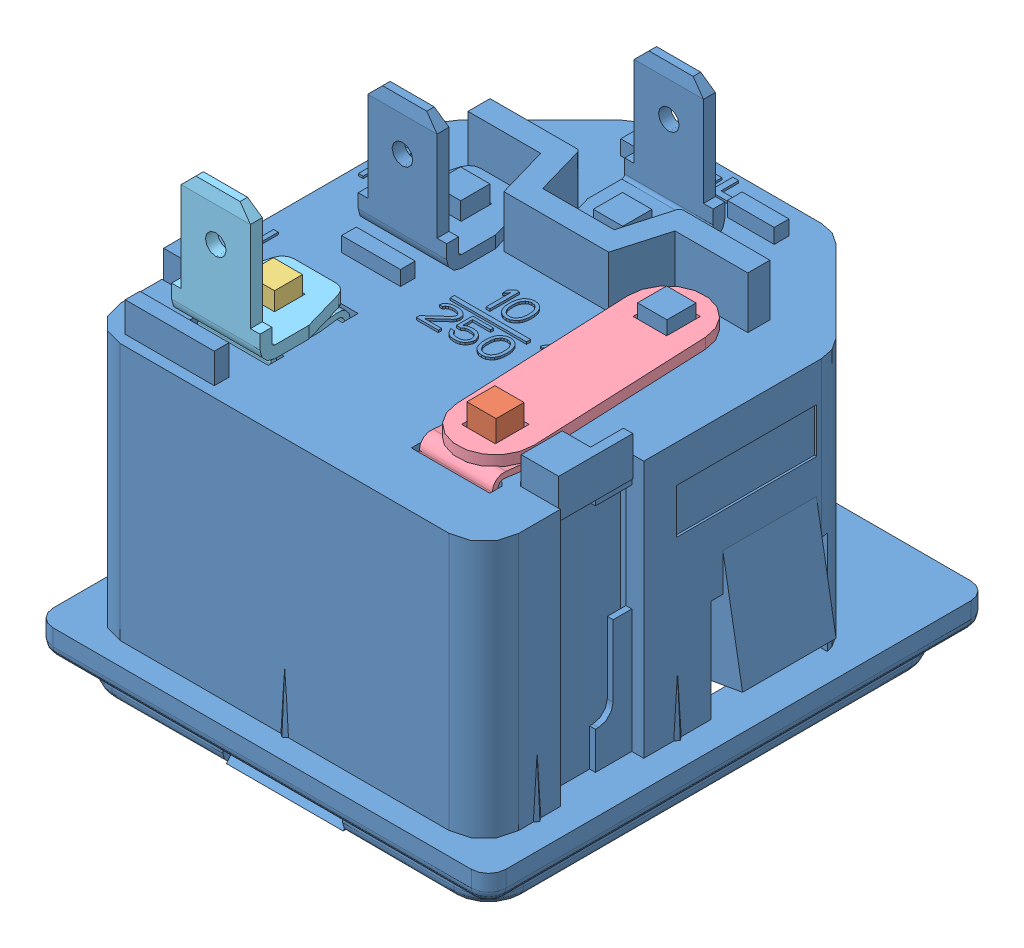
SolidWorks assembly pf0011-10-48_Temp.SLDASM, configuration Default (file format 4100). Lengths in mm.
Overall size (30.73 30.7 33.91).
5 component instances, 5 part files, 0 mates.
Components (placement in the parent):
- pf0011-10-48_01-1: pf0011-10-48_01.SLDPRT [Default] at origin size (30.73 30.2 33.91)
- pf0011-10-48_02-1: pf0011-10-48_02.SLDPRT [Default] at origin size (5 8.1 1.9)
- pf0011-10-48_03-1: pf0011-10-48_03.SLDPRT [Default] at origin size (5 8.1 1.9)
- pf0011-10-48_04-1: pf0011-10-48_04.SLDPRT [Default] at origin size (5.61 13.47 17.38)
- pf0011-10-48_05-1: pf0011-10-48_05.SLDPRT [Default] at origin size (6 21.68 6.73)
